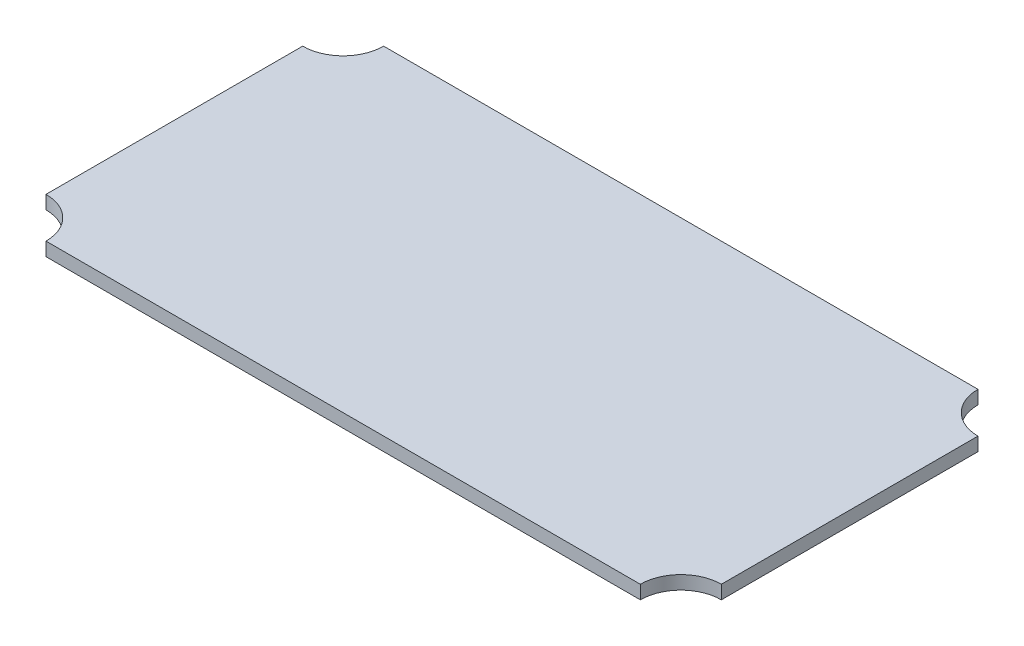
from build123d import *

# Parameters (mm, degrees)
SKIZZE1_W               = 500
SKIZZE1_H               = 250
LINEAR_AUSTRAGEN1_DEPTH = 5
SKIZZE2_R               = 30
AUSKLINKUNG_DEPTH       = 280.687325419


with BuildPart() as part:
    # Skizze1 → Linear austragen1 (new, symmetric)
    with BuildSketch(Plane(origin=(0, 0, 0), x_dir=(1, 0, 0), z_dir=(0, 1, 0))):
        Rectangle(SKIZZE1_W, SKIZZE1_H)
    extrude(amount=LINEAR_AUSTRAGEN1_DEPTH, both=True)

    # Skizze2 → Ausklinkung (cut, through all)
    with BuildSketch(Plane(origin=(0, 5, 0), x_dir=(-1, 0, 0), z_dir=(0, 1, 0))):
        with Locations((250, 125)):
            Circle(SKIZZE2_R)
        with Locations((250, -125)):
            Circle(SKIZZE2_R)
        with Locations((-250, -125)):
            Circle(SKIZZE2_R)
        with Locations((-250, 125)):
            Circle(SKIZZE2_R)
    extrude(amount=-AUSKLINKUNG_DEPTH, mode=Mode.SUBTRACT)


solid = part.part
